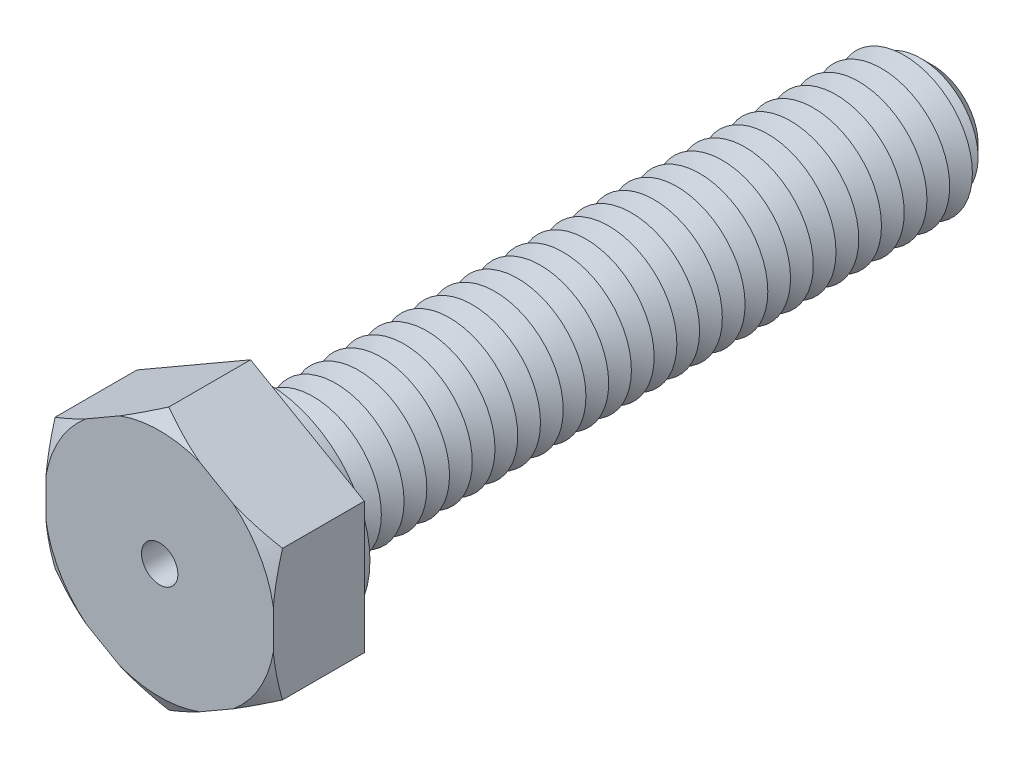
from build123d import *

# Parameters (mm, degrees)
BOSS_EXTRUDE1_DEPTH = 4
SKETCH3_R           = 3
BOSS_EXTRUDE2_DEPTH = 30
SKETCH4_R           = 4.5
BOSS_EXTRUDE3_DEPTH = 0.75
CHAMFER1_SIZE       = 1
LPATTERN1_COUNT     = 29
LPATTERN1_PITCH     = 1
SKETCH8_R           = 0.8
CUT_EXTRUDE1_DEPTH  = 34


with BuildPart() as part:
    # Sketch2 → Boss-Extrude1 (new body)
    with BuildSketch(Plane.XY):
        Polygon((0, 5.773502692), (-5, 2.886751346), (-5, -2.886751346), (0, -5.773502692), (5, -2.886751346), (5, 2.886751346), align=None)
    extrude(amount=BOSS_EXTRUDE1_DEPTH)

    # Sketch3 → Boss-Extrude2 (add)
    with BuildSketch(Plane(origin=(0, 0, 0), x_dir=(-1, 0, 0), z_dir=(0, 0, -1))):
        Circle(SKETCH3_R)
    extrude(amount=BOSS_EXTRUDE2_DEPTH)

    # Sketch4 → Boss-Extrude3 (add)
    with BuildSketch(Plane(origin=(0, 0, 0), x_dir=(-1, 0, 0), z_dir=(0, 0, -1))):
        with Locations(Location((0, 0, 0), (0, 0, 180))):
            Circle(SKETCH4_R)
    extrude(amount=BOSS_EXTRUDE3_DEPTH)

    # Chamfer1
    chamfer1_edges = [part.edges().sort_by_distance(p)[0] for p in [
        (3, 0, -30),
    ]]
    chamfer(chamfer1_edges, length=CHAMFER1_SIZE)

    # Sketch6 → Cut-Revolve1 (revolve, cut)
    with BuildSketch(Plane(origin=(0, 0, 0), x_dir=(0, 0, -1), z_dir=(1, 0, 0)), mode=Mode.PRIVATE) as cut_revolve1_sk:
        Polygon((0.75, 3), (1.25, 2.133974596), (1.75, 3), align=None)
    cut_revolve1 = revolve(cut_revolve1_sk.sketch.rotate(Axis((0, 0, 3.211670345), (0, 0, -1)), 90), axis=Axis((0, 0, 3.211670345), (0, 0, -1)), mode=Mode.SUBTRACT)

    # LPattern1: Cut-Revolve1 ×29
    with Locations(*[(0, 0, -i * LPATTERN1_PITCH) for i in range(1, LPATTERN1_COUNT)]):
        add(cut_revolve1, mode=Mode.SUBTRACT)

    # Sketch7 → Cut-Revolve2 (revolve, cut)
    with BuildSketch(Plane(origin=(0, 0, 0), x_dir=(0, 0, -1), z_dir=(1, 0, 0)), mode=Mode.PRIVATE) as cut_revolve2_sk:
        Polygon((-4, 5.773502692), (-4, 5.073502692), (-3.595854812, 5.773502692), align=None)
    revolve(cut_revolve2_sk.sketch.rotate(Axis((0, 0, 3.211670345), (0, 0, -1)), 270), axis=Axis((0, 0, 3.211670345), (0, 0, -1)), mode=Mode.SUBTRACT)

    # Sketch8 → Cut-Extrude1 (cut)
    with BuildSketch(Plane.XY.offset(4)):
        Circle(SKETCH8_R)
    extrude(amount=-CUT_EXTRUDE1_DEPTH, mode=Mode.SUBTRACT)


solid = part.part
